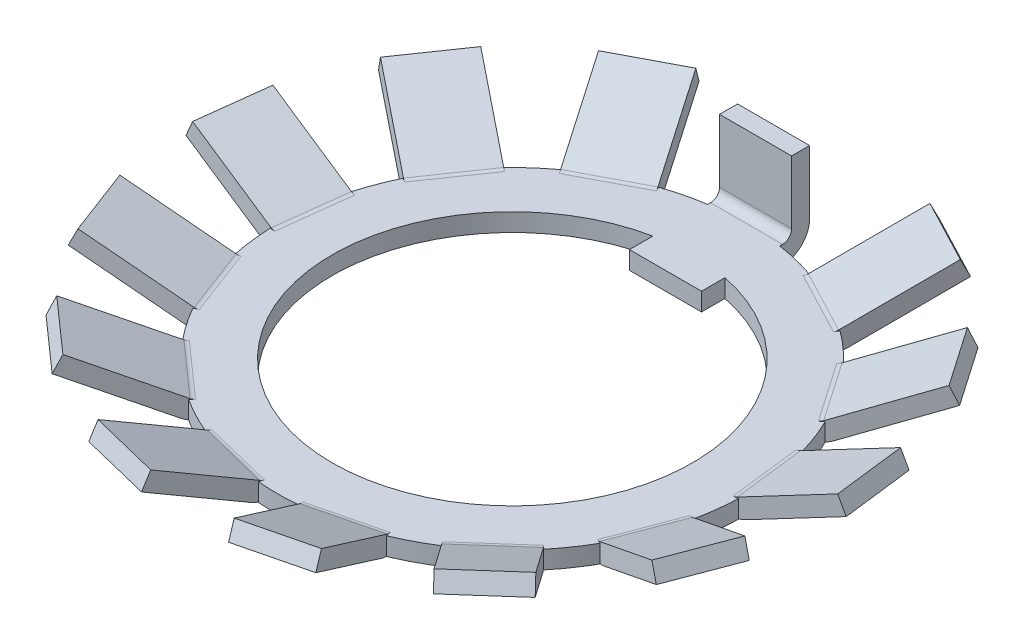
from build123d import *

# Parameters (mm, degrees)
ESQUISSE1_W             = 3
ESQUISSE1_H             = 1
LANGUETTE_PLI_E_DEPTH   = 2
LANGUETTE_DEPTH         = 2
NBR_DE_LANGUETTES_COUNT = 12
NBR_DE_LANGUETTES_ANGLE = 304.615384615


with BuildPart() as part:
    # Esquisse1 → Base (revolve)
    with BuildSketch(Plane.XY, mode=Mode.PRIVATE) as base_sk:
        with Locations((11.5, 0.5)):
            Rectangle(ESQUISSE1_W, ESQUISSE1_H)
    revolve(base_sk.sketch.rotate(Axis((0, 0, 0), (0, 1, 0)), 90), axis=Axis((0, 0, 0), (0, 1, 0)))

    # Esquisse3 → Languette pli_e (add, symmetric)
    with BuildSketch(Plane(origin=(0, 0, 0), x_dir=(0, 0, -1), z_dir=(1, 0, 0))):
        with BuildLine():
            Line((13.5, 5), (13.5, 1.5))
            ThreePointArc((13.5, 1.5), (13.353553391, 1.146446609), (13, 1))
            Line((13, 1), (10, 1))
            Line((10, 1), (8.5, 1))
            Line((8.5, 1), (8.5, 0))
            Line((8.5, 0), (10, 0))
            Line((10, 0), (13, 0))
            ThreePointArc((13, 0), (14.060660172, 0.439339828), (14.5, 1.5))
            Line((14.5, 1.5), (14.5, 5))
            Line((14.5, 5), (13.5, 5))
        make_face()
    extrude(amount=LANGUETTE_PLI_E_DEPTH, both=True)

    # Esquisse2 → Languette (add, symmetric)
    with BuildSketch(Plane(origin=(0, 0, 0), x_dir=(-0.46472317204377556, 0, 0.8854560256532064), z_dir=(-0.8854560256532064, 0, -0.46472317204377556))):
        with BuildLine():
            Line((-10, 1), (-12.577381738, 1))
            ThreePointArc((-12.577381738, 1), (-12.685601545, 1.011851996), (-12.788690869, 1.046846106))
            Line((-12.788690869, 1.046846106), (-17.788690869, 3.378384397))
            Line((-17.788690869, 3.378384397), (-18.211309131, 2.47207661))
            Line((-18.211309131, 2.47207661), (-13.211309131, 0.140538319))
            ThreePointArc((-13.211309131, 0.140538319), (-12.902041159, 0.035555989), (-12.577381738, 0))
            Line((-12.577381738, 0), (-10, 0))
            Line((-10, 0), (-10, 1))
        make_face()
    languette = extrude(amount=LANGUETTE_DEPTH, both=True)

    # Nbr de languettes: Languette ×12 about axis
    nbr_de_languettes_axis = Axis((0, 0, 0), (0, -1, 0))
    for i in range(1, NBR_DE_LANGUETTES_COUNT):
        add(languette.rotate(nbr_de_languettes_axis, i * NBR_DE_LANGUETTES_ANGLE / (NBR_DE_LANGUETTES_COUNT - 1)))


solid = part.part
